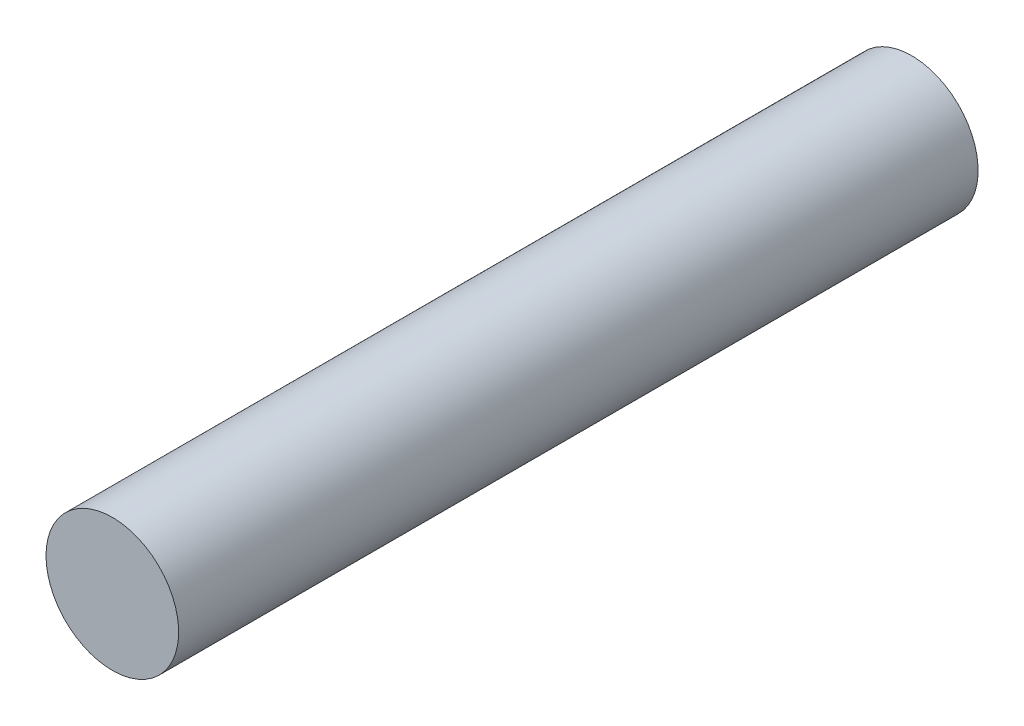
ISO-10303-21;
HEADER;
FILE_DESCRIPTION(('STEP AP214'),'2;1');
FILE_NAME('part.step','',(''),(''),'','','');
FILE_SCHEMA(('AUTOMOTIVE_DESIGN { 1 0 10303 214 1 1 1 1 }'));
ENDSEC;
DATA;
#1=APPLICATION_CONTEXT('core data for automotive mechanical design processes');
#2=APPLICATION_PROTOCOL_DEFINITION('international standard','automotive_design',2000,#1);
#3=PRODUCT_CONTEXT('',#1,'mechanical');
#4=PRODUCT('Part','Part','',(#3));
#5=PRODUCT_RELATED_PRODUCT_CATEGORY('part','',(#4));
#6=PRODUCT_DEFINITION_FORMATION('','',#4);
#7=PRODUCT_DEFINITION_CONTEXT('part definition',#1,'design');
#8=PRODUCT_DEFINITION('design','',#6,#7);
#9=PRODUCT_DEFINITION_SHAPE('','',#8);
#10=(LENGTH_UNIT() NAMED_UNIT(*) SI_UNIT(.MILLI.,.METRE.));
#11=(NAMED_UNIT(*) PLANE_ANGLE_UNIT() SI_UNIT($,.RADIAN.));
#12=(NAMED_UNIT(*) SI_UNIT($,.STERADIAN.) SOLID_ANGLE_UNIT());
#13=UNCERTAINTY_MEASURE_WITH_UNIT(LENGTH_MEASURE(1.E-05),#10,'distance_accuracy_value','');
#14=(GEOMETRIC_REPRESENTATION_CONTEXT(3) GLOBAL_UNCERTAINTY_ASSIGNED_CONTEXT((#13)) GLOBAL_UNIT_ASSIGNED_CONTEXT((#10,
#11,#12)) REPRESENTATION_CONTEXT('',''));
#15=CARTESIAN_POINT('',(0.,0.,0.));
#16=DIRECTION('',(0.,0.,1.));
#17=DIRECTION('',(1.,0.,0.));
#18=AXIS2_PLACEMENT_3D('',#15,#16,#17);
#19=CARTESIAN_POINT('',(0.,0.,229.));
#20=DIRECTION('',(0.,0.,-1.));
#21=DIRECTION('',(-1.,0.,0.));
#22=AXIS2_PLACEMENT_3D('',#19,#20,#21);
#23=CYLINDRICAL_SURFACE('',#22,38.);
#24=CARTESIAN_POINT('',(0.,0.,229.));
#25=DIRECTION('',(0.,0.,1.));
#26=DIRECTION('',(1.,0.,0.));
#27=AXIS2_PLACEMENT_3D('',#24,#25,#26);
#28=CIRCLE('',#27,38.);
#29=CARTESIAN_POINT('',(-38.,0.,229.));
#30=VERTEX_POINT('',#29);
#31=EDGE_CURVE('E10',#30,#30,#28,.T.);
#32=CARTESIAN_POINT('',(0.,0.,-229.));
#33=DIRECTION('',(0.,0.,1.));
#34=DIRECTION('',(1.,0.,0.));
#35=AXIS2_PLACEMENT_3D('',#32,#33,#34);
#36=CIRCLE('',#35,38.);
#37=CARTESIAN_POINT('',(-38.,0.,-229.));
#38=VERTEX_POINT('',#37);
#39=EDGE_CURVE('E34',#38,#38,#36,.T.);
#40=CARTESIAN_POINT('',(-38.,0.,229.));
#41=CARTESIAN_POINT('',(-38.,0.,224.229166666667));
#42=CARTESIAN_POINT('',(-38.,0.,219.458333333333));
#43=CARTESIAN_POINT('',(-38.,0.,209.916666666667));
#44=CARTESIAN_POINT('',(-38.,0.,205.145833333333));
#45=CARTESIAN_POINT('',(-38.,0.,195.604166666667));
#46=CARTESIAN_POINT('',(-38.,0.,190.833333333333));
#47=CARTESIAN_POINT('',(-38.,0.,181.291666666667));
#48=CARTESIAN_POINT('',(-38.,0.,176.520833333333));
#49=CARTESIAN_POINT('',(-38.,0.,166.979166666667));
#50=CARTESIAN_POINT('',(-38.,0.,162.208333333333));
#51=CARTESIAN_POINT('',(-38.,0.,152.666666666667));
#52=CARTESIAN_POINT('',(-38.,0.,147.895833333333));
#53=CARTESIAN_POINT('',(-38.,0.,138.354166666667));
#54=CARTESIAN_POINT('',(-38.,0.,133.583333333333));
#55=CARTESIAN_POINT('',(-38.,0.,124.041666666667));
#56=CARTESIAN_POINT('',(-38.,0.,119.270833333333));
#57=CARTESIAN_POINT('',(-38.,0.,109.729166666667));
#58=CARTESIAN_POINT('',(-38.,0.,104.958333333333));
#59=CARTESIAN_POINT('',(-38.,0.,95.4166666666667));
#60=CARTESIAN_POINT('',(-38.,0.,90.6458333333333));
#61=CARTESIAN_POINT('',(-38.,0.,81.1041666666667));
#62=CARTESIAN_POINT('',(-38.,0.,76.3333333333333));
#63=CARTESIAN_POINT('',(-38.,0.,66.7916666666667));
#64=CARTESIAN_POINT('',(-38.,0.,62.0208333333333));
#65=CARTESIAN_POINT('',(-38.,0.,52.4791666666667));
#66=CARTESIAN_POINT('',(-38.,0.,47.7083333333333));
#67=CARTESIAN_POINT('',(-38.,0.,38.1666666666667));
#68=CARTESIAN_POINT('',(-38.,0.,33.3958333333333));
#69=CARTESIAN_POINT('',(-38.,0.,23.8541666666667));
#70=CARTESIAN_POINT('',(-38.,0.,19.0833333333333));
#71=CARTESIAN_POINT('',(-38.,0.,9.54166666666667));
#72=CARTESIAN_POINT('',(-38.,0.,4.77083333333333));
#73=CARTESIAN_POINT('',(-38.,0.,-4.77083333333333));
#74=CARTESIAN_POINT('',(-38.,0.,-9.54166666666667));
#75=CARTESIAN_POINT('',(-38.,0.,-19.0833333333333));
#76=CARTESIAN_POINT('',(-38.,0.,-23.8541666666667));
#77=CARTESIAN_POINT('',(-38.,0.,-33.3958333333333));
#78=CARTESIAN_POINT('',(-38.,0.,-38.1666666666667));
#79=CARTESIAN_POINT('',(-38.,0.,-47.7083333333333));
#80=CARTESIAN_POINT('',(-38.,0.,-52.4791666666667));
#81=CARTESIAN_POINT('',(-38.,0.,-62.0208333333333));
#82=CARTESIAN_POINT('',(-38.,0.,-66.7916666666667));
#83=CARTESIAN_POINT('',(-38.,0.,-76.3333333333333));
#84=CARTESIAN_POINT('',(-38.,0.,-81.1041666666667));
#85=CARTESIAN_POINT('',(-38.,0.,-90.6458333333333));
#86=CARTESIAN_POINT('',(-38.,0.,-95.4166666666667));
#87=CARTESIAN_POINT('',(-38.,0.,-104.958333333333));
#88=CARTESIAN_POINT('',(-38.,0.,-109.729166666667));
#89=CARTESIAN_POINT('',(-38.,0.,-119.270833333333));
#90=CARTESIAN_POINT('',(-38.,0.,-124.041666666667));
#91=CARTESIAN_POINT('',(-38.,0.,-133.583333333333));
#92=CARTESIAN_POINT('',(-38.,0.,-138.354166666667));
#93=CARTESIAN_POINT('',(-38.,0.,-147.895833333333));
#94=CARTESIAN_POINT('',(-38.,0.,-152.666666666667));
#95=CARTESIAN_POINT('',(-38.,0.,-162.208333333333));
#96=CARTESIAN_POINT('',(-38.,0.,-166.979166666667));
#97=CARTESIAN_POINT('',(-38.,0.,-176.520833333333));
#98=CARTESIAN_POINT('',(-38.,0.,-181.291666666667));
#99=CARTESIAN_POINT('',(-38.,0.,-190.833333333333));
#100=CARTESIAN_POINT('',(-38.,0.,-195.604166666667));
#101=CARTESIAN_POINT('',(-38.,0.,-205.145833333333));
#102=CARTESIAN_POINT('',(-38.,0.,-209.916666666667));
#103=CARTESIAN_POINT('',(-38.,0.,-219.458333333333));
#104=CARTESIAN_POINT('',(-38.,0.,-224.229166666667));
#105=CARTESIAN_POINT('',(-38.,0.,-229.));
#106=B_SPLINE_CURVE_WITH_KNOTS('',3,(#40,#41,#42,#43,#44,#45,#46,#47,#48,#49,#50,#51,#52,#53,
#54,#55,#56,#57,#58,#59,#60,#61,#62,#63,#64,#65,#66,#67,#68,#69,#70,#71,#72,#73,#74,#75,#76,#77,
#78,#79,#80,#81,#82,#83,#84,#85,#86,#87,#88,#89,#90,#91,#92,#93,#94,#95,#96,#97,#98,#99,#100,
#101,#102,#103,#104,#105),.UNSPECIFIED.,.F.,.F.,(4,2,2,2,2,2,2,2,2,2,2,2,2,2,2,2,2,2,2,2,2,2,2,
2,2,2,2,2,2,2,2,2,4),(0.,14.3125,28.625,42.9375,57.25,71.5625,85.875,100.1875,114.5,128.8125,
143.125,157.4375,171.75,186.0625,200.375,214.6875,229.,243.3125,257.625,271.9375,286.25,
300.5625,314.875,329.1875,343.5,357.8125,372.125,386.4375,400.75,415.0625,429.375,443.6875,
458.),.UNSPECIFIED.);
#107=EDGE_CURVE('BSEAM31',#30,#38,#106,.T.);
#108=ORIENTED_EDGE('',*,*,#31,.F.);
#109=ORIENTED_EDGE('',*,*,#39,.T.);
#110=ORIENTED_EDGE('',*,*,#107,.T.);
#111=ORIENTED_EDGE('',*,*,#107,.F.);
#112=EDGE_LOOP('',(#108,#110,#109,#111));
#113=FACE_BOUND('',#112,.T.);
#114=ADVANCED_FACE('F31',(#113),#23,.T.);
#115=CARTESIAN_POINT('',(0.,0.,229.));
#116=DIRECTION('',(0.,0.,1.));
#117=DIRECTION('',(1.,0.,0.));
#118=AXIS2_PLACEMENT_3D('',#115,#116,#117);
#119=PLANE('',#118);
#120=ORIENTED_EDGE('',*,*,#31,.T.);
#121=EDGE_LOOP('',(#120));
#122=FACE_BOUND('',#121,.T.);
#123=ADVANCED_FACE('F46',(#122),#119,.T.);
#124=CARTESIAN_POINT('',(0.,0.,-229.));
#125=DIRECTION('',(0.,0.,1.));
#126=DIRECTION('',(1.,0.,0.));
#127=AXIS2_PLACEMENT_3D('',#124,#125,#126);
#128=PLANE('',#127);
#129=ORIENTED_EDGE('',*,*,#39,.F.);
#130=EDGE_LOOP('',(#129));
#131=FACE_BOUND('',#130,.T.);
#132=ADVANCED_FACE('F44',(#131),#128,.F.);
#133=CLOSED_SHELL('',(#114,#123,#132));
#134=MANIFOLD_SOLID_BREP('B2',#133);
#135=ADVANCED_BREP_SHAPE_REPRESENTATION('',(#18,#134),#14);
#136=SHAPE_DEFINITION_REPRESENTATION(#9,#135);
ENDSEC;
END-ISO-10303-21;
